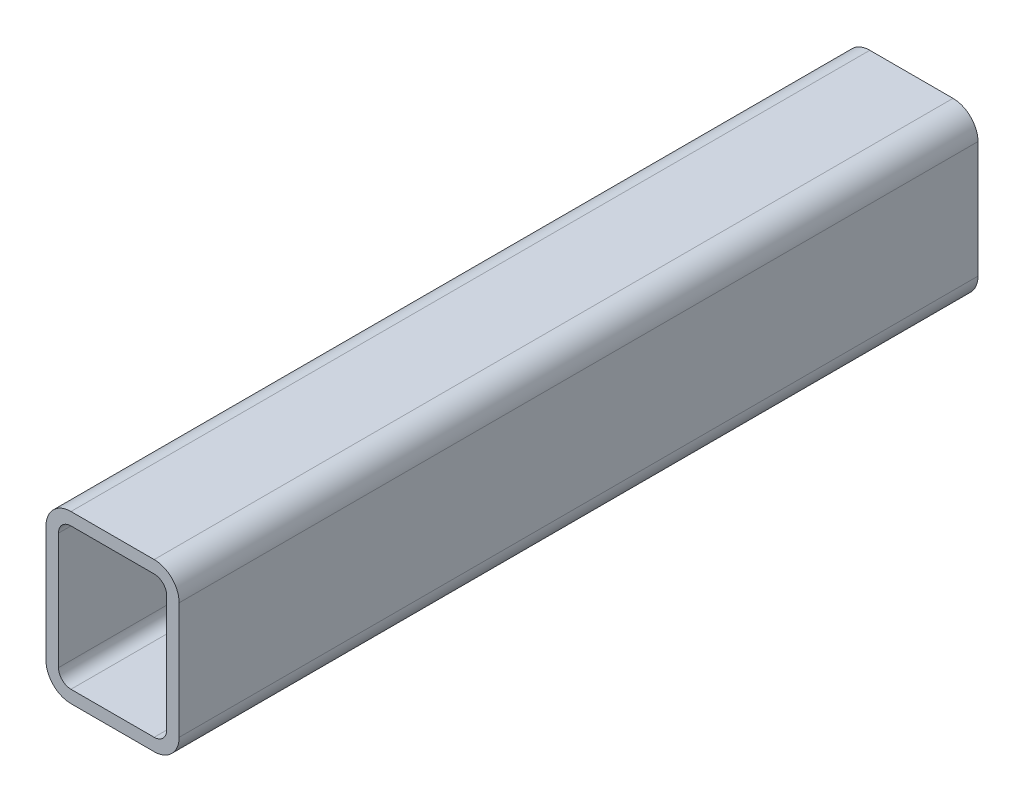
ISO-10303-21;
HEADER;
FILE_DESCRIPTION(('STEP AP214'),'2;1');
FILE_NAME('part.step','',(''),(''),'','','');
FILE_SCHEMA(('AUTOMOTIVE_DESIGN { 1 0 10303 214 1 1 1 1 }'));
ENDSEC;
DATA;
#1=APPLICATION_CONTEXT('core data for automotive mechanical design processes');
#2=APPLICATION_PROTOCOL_DEFINITION('international standard','automotive_design',2000,#1);
#3=PRODUCT_CONTEXT('',#1,'mechanical');
#4=PRODUCT('Part','Part','',(#3));
#5=PRODUCT_RELATED_PRODUCT_CATEGORY('part','',(#4));
#6=PRODUCT_DEFINITION_FORMATION('','',#4);
#7=PRODUCT_DEFINITION_CONTEXT('part definition',#1,'design');
#8=PRODUCT_DEFINITION('design','',#6,#7);
#9=PRODUCT_DEFINITION_SHAPE('','',#8);
#10=(LENGTH_UNIT() NAMED_UNIT(*) SI_UNIT(.MILLI.,.METRE.));
#11=(NAMED_UNIT(*) PLANE_ANGLE_UNIT() SI_UNIT($,.RADIAN.));
#12=(NAMED_UNIT(*) SI_UNIT($,.STERADIAN.) SOLID_ANGLE_UNIT());
#13=UNCERTAINTY_MEASURE_WITH_UNIT(LENGTH_MEASURE(1.E-05),#10,'distance_accuracy_value','');
#14=(GEOMETRIC_REPRESENTATION_CONTEXT(3) GLOBAL_UNCERTAINTY_ASSIGNED_CONTEXT((#13)) GLOBAL_UNIT_ASSIGNED_CONTEXT((#10,
#11,#12)) REPRESENTATION_CONTEXT('',''));
#15=CARTESIAN_POINT('',(0.,0.,0.));
#16=DIRECTION('',(0.,0.,1.));
#17=DIRECTION('',(1.,0.,0.));
#18=AXIS2_PLACEMENT_3D('',#15,#16,#17);
#19=CARTESIAN_POINT('',(9.525,53.975,304.8));
#20=DIRECTION('',(0.,0.,1.));
#21=DIRECTION('',(1.,0.,0.));
#22=AXIS2_PLACEMENT_3D('',#19,#20,#21);
#23=PLANE('',#22);
#24=CARTESIAN_POINT('',(9.525,53.975,304.8));
#25=DIRECTION('',(0.,0.,1.));
#26=DIRECTION('',(1.,0.,0.));
#27=AXIS2_PLACEMENT_3D('',#24,#25,#26);
#28=CIRCLE('',#27,9.525);
#29=CARTESIAN_POINT('',(9.525,63.5,304.8));
#30=VERTEX_POINT('',#29);
#31=CARTESIAN_POINT('',(0.,53.975,304.8));
#32=VERTEX_POINT('',#31);
#33=EDGE_CURVE('E211',#30,#32,#28,.T.);
#34=ORIENTED_EDGE('',*,*,#33,.T.);
#35=DIRECTION('',(0.,-1.,0.));
#36=VECTOR('',#35,1.);
#37=CARTESIAN_POINT('',(0.,9.525,304.8));
#38=LINE('',#37,#36);
#39=CARTESIAN_POINT('',(0.,9.525,304.8));
#40=VERTEX_POINT('',#39);
#41=EDGE_CURVE('E214',#32,#40,#38,.T.);
#42=ORIENTED_EDGE('',*,*,#41,.T.);
#43=CARTESIAN_POINT('',(9.525,9.525,304.8));
#44=DIRECTION('',(0.,0.,1.));
#45=DIRECTION('',(1.,0.,0.));
#46=AXIS2_PLACEMENT_3D('',#43,#44,#45);
#47=CIRCLE('',#46,9.525);
#48=CARTESIAN_POINT('',(9.525,0.,304.8));
#49=VERTEX_POINT('',#48);
#50=EDGE_CURVE('E217',#40,#49,#47,.T.);
#51=ORIENTED_EDGE('',*,*,#50,.T.);
#52=DIRECTION('',(1.,0.,0.));
#53=VECTOR('',#52,1.);
#54=CARTESIAN_POINT('',(41.275,0.,304.8));
#55=LINE('',#54,#53);
#56=CARTESIAN_POINT('',(41.275,0.,304.8));
#57=VERTEX_POINT('',#56);
#58=EDGE_CURVE('E219',#49,#57,#55,.T.);
#59=ORIENTED_EDGE('',*,*,#58,.T.);
#60=CARTESIAN_POINT('',(41.275,9.525,304.8));
#61=DIRECTION('',(0.,0.,1.));
#62=DIRECTION('',(1.,0.,0.));
#63=AXIS2_PLACEMENT_3D('',#60,#61,#62);
#64=CIRCLE('',#63,9.525);
#65=CARTESIAN_POINT('',(50.8,9.525,304.8));
#66=VERTEX_POINT('',#65);
#67=EDGE_CURVE('E221',#57,#66,#64,.T.);
#68=ORIENTED_EDGE('',*,*,#67,.T.);
#69=DIRECTION('',(0.,1.,0.));
#70=VECTOR('',#69,1.);
#71=CARTESIAN_POINT('',(50.8,53.975,304.8));
#72=LINE('',#71,#70);
#73=CARTESIAN_POINT('',(50.8,53.975,304.8));
#74=VERTEX_POINT('',#73);
#75=EDGE_CURVE('E223',#66,#74,#72,.T.);
#76=ORIENTED_EDGE('',*,*,#75,.T.);
#77=CARTESIAN_POINT('',(41.275,53.975,304.8));
#78=DIRECTION('',(0.,0.,1.));
#79=DIRECTION('',(1.,0.,0.));
#80=AXIS2_PLACEMENT_3D('',#77,#78,#79);
#81=CIRCLE('',#80,9.525);
#82=CARTESIAN_POINT('',(41.275,63.5,304.8));
#83=VERTEX_POINT('',#82);
#84=EDGE_CURVE('E225',#74,#83,#81,.T.);
#85=ORIENTED_EDGE('',*,*,#84,.T.);
#86=DIRECTION('',(-1.,0.,0.));
#87=VECTOR('',#86,1.);
#88=CARTESIAN_POINT('',(9.525,63.5,304.8));
#89=LINE('',#88,#87);
#90=EDGE_CURVE('E227',#83,#30,#89,.T.);
#91=ORIENTED_EDGE('',*,*,#90,.T.);
#92=EDGE_LOOP('',(#34,#42,#51,#59,#68,#76,#85,#91));
#93=FACE_BOUND('',#92,.T.);
#94=DIRECTION('',(0.,-1.,0.));
#95=VECTOR('',#94,1.);
#96=CARTESIAN_POINT('',(4.7625,9.525,304.8));
#97=LINE('',#96,#95);
#98=CARTESIAN_POINT('',(4.7625,53.975,304.8));
#99=VERTEX_POINT('',#98);
#100=CARTESIAN_POINT('',(4.7625,9.525,304.8));
#101=VERTEX_POINT('',#100);
#102=EDGE_CURVE('E154',#99,#101,#97,.T.);
#103=ORIENTED_EDGE('',*,*,#102,.F.);
#104=CARTESIAN_POINT('',(9.525,53.975,304.8));
#105=DIRECTION('',(0.,0.,1.));
#106=DIRECTION('',(1.,0.,0.));
#107=AXIS2_PLACEMENT_3D('',#104,#105,#106);
#108=CIRCLE('',#107,4.76249999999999);
#109=CARTESIAN_POINT('',(9.525,58.7375,304.8));
#110=VERTEX_POINT('',#109);
#111=EDGE_CURVE('E146',#110,#99,#108,.T.);
#112=ORIENTED_EDGE('',*,*,#111,.F.);
#113=DIRECTION('',(-1.,0.,0.));
#114=VECTOR('',#113,1.);
#115=CARTESIAN_POINT('',(9.525,58.7375,304.8));
#116=LINE('',#115,#114);
#117=CARTESIAN_POINT('',(41.275,58.7375,304.8));
#118=VERTEX_POINT('',#117);
#119=EDGE_CURVE('E179',#118,#110,#116,.T.);
#120=ORIENTED_EDGE('',*,*,#119,.F.);
#121=CARTESIAN_POINT('',(41.275,53.975,304.8));
#122=DIRECTION('',(0.,0.,1.));
#123=DIRECTION('',(1.,0.,0.));
#124=AXIS2_PLACEMENT_3D('',#121,#122,#123);
#125=CIRCLE('',#124,4.7625);
#126=CARTESIAN_POINT('',(46.0375,53.975,304.8));
#127=VERTEX_POINT('',#126);
#128=EDGE_CURVE('E177',#127,#118,#125,.T.);
#129=ORIENTED_EDGE('',*,*,#128,.F.);
#130=DIRECTION('',(0.,1.,0.));
#131=VECTOR('',#130,1.);
#132=CARTESIAN_POINT('',(46.0375,53.975,304.8));
#133=LINE('',#132,#131);
#134=CARTESIAN_POINT('',(46.0375,9.525,304.8));
#135=VERTEX_POINT('',#134);
#136=EDGE_CURVE('E175',#135,#127,#133,.T.);
#137=ORIENTED_EDGE('',*,*,#136,.F.);
#138=CARTESIAN_POINT('',(41.275,9.525,304.8));
#139=DIRECTION('',(0.,0.,1.));
#140=DIRECTION('',(1.,0.,0.));
#141=AXIS2_PLACEMENT_3D('',#138,#139,#140);
#142=CIRCLE('',#141,4.7625);
#143=CARTESIAN_POINT('',(41.275,4.7625,304.8));
#144=VERTEX_POINT('',#143);
#145=EDGE_CURVE('E173',#144,#135,#142,.T.);
#146=ORIENTED_EDGE('',*,*,#145,.F.);
#147=DIRECTION('',(1.,0.,0.));
#148=VECTOR('',#147,1.);
#149=CARTESIAN_POINT('',(41.275,4.7625,304.8));
#150=LINE('',#149,#148);
#151=CARTESIAN_POINT('',(9.525,4.7625,304.8));
#152=VERTEX_POINT('',#151);
#153=EDGE_CURVE('E169',#152,#144,#150,.T.);
#154=ORIENTED_EDGE('',*,*,#153,.F.);
#155=CARTESIAN_POINT('',(9.525,9.525,304.8));
#156=DIRECTION('',(0.,0.,1.));
#157=DIRECTION('',(1.,0.,0.));
#158=AXIS2_PLACEMENT_3D('',#155,#156,#157);
#159=CIRCLE('',#158,4.7625);
#160=EDGE_CURVE('E167',#101,#152,#159,.T.);
#161=ORIENTED_EDGE('',*,*,#160,.F.);
#162=EDGE_LOOP('',(#103,#112,#120,#129,#137,#146,#154,#161));
#163=FACE_BOUND('',#162,.T.);
#164=ADVANCED_FACE('F33',(#93,#163),#23,.T.);
#165=CARTESIAN_POINT('',(9.525,53.975,0.));
#166=DIRECTION('',(0.,0.,1.));
#167=DIRECTION('',(1.,0.,0.));
#168=AXIS2_PLACEMENT_3D('',#165,#166,#167);
#169=PLANE('',#168);
#170=CARTESIAN_POINT('',(9.525,53.975,0.));
#171=DIRECTION('',(0.,0.,1.));
#172=DIRECTION('',(1.,0.,0.));
#173=AXIS2_PLACEMENT_3D('',#170,#171,#172);
#174=CIRCLE('',#173,9.525);
#175=CARTESIAN_POINT('',(9.525,63.5,0.));
#176=VERTEX_POINT('',#175);
#177=CARTESIAN_POINT('',(0.,53.975,0.));
#178=VERTEX_POINT('',#177);
#179=EDGE_CURVE('E162',#176,#178,#174,.T.);
#180=ORIENTED_EDGE('',*,*,#179,.F.);
#181=DIRECTION('',(-1.,0.,0.));
#182=VECTOR('',#181,1.);
#183=CARTESIAN_POINT('',(9.525,63.5,0.));
#184=LINE('',#183,#182);
#185=CARTESIAN_POINT('',(41.275,63.5,0.));
#186=VERTEX_POINT('',#185);
#187=EDGE_CURVE('E215',#186,#176,#184,.T.);
#188=ORIENTED_EDGE('',*,*,#187,.F.);
#189=CARTESIAN_POINT('',(41.275,53.975,0.));
#190=DIRECTION('',(0.,0.,1.));
#191=DIRECTION('',(1.,0.,0.));
#192=AXIS2_PLACEMENT_3D('',#189,#190,#191);
#193=CIRCLE('',#192,9.525);
#194=CARTESIAN_POINT('',(50.8,53.975,0.));
#195=VERTEX_POINT('',#194);
#196=EDGE_CURVE('E242',#195,#186,#193,.T.);
#197=ORIENTED_EDGE('',*,*,#196,.F.);
#198=DIRECTION('',(0.,1.,0.));
#199=VECTOR('',#198,1.);
#200=CARTESIAN_POINT('',(50.8,53.975,0.));
#201=LINE('',#200,#199);
#202=CARTESIAN_POINT('',(50.8,9.525,0.));
#203=VERTEX_POINT('',#202);
#204=EDGE_CURVE('E240',#203,#195,#201,.T.);
#205=ORIENTED_EDGE('',*,*,#204,.F.);
#206=CARTESIAN_POINT('',(41.275,9.525,0.));
#207=DIRECTION('',(0.,0.,1.));
#208=DIRECTION('',(1.,0.,0.));
#209=AXIS2_PLACEMENT_3D('',#206,#207,#208);
#210=CIRCLE('',#209,9.525);
#211=CARTESIAN_POINT('',(41.275,0.,0.));
#212=VERTEX_POINT('',#211);
#213=EDGE_CURVE('E238',#212,#203,#210,.T.);
#214=ORIENTED_EDGE('',*,*,#213,.F.);
#215=DIRECTION('',(1.,0.,0.));
#216=VECTOR('',#215,1.);
#217=CARTESIAN_POINT('',(41.275,0.,0.));
#218=LINE('',#217,#216);
#219=CARTESIAN_POINT('',(9.525,0.,0.));
#220=VERTEX_POINT('',#219);
#221=EDGE_CURVE('E236',#220,#212,#218,.T.);
#222=ORIENTED_EDGE('',*,*,#221,.F.);
#223=CARTESIAN_POINT('',(9.525,9.525,0.));
#224=DIRECTION('',(0.,0.,1.));
#225=DIRECTION('',(1.,0.,0.));
#226=AXIS2_PLACEMENT_3D('',#223,#224,#225);
#227=CIRCLE('',#226,9.525);
#228=CARTESIAN_POINT('',(0.,9.525,0.));
#229=VERTEX_POINT('',#228);
#230=EDGE_CURVE('E234',#229,#220,#227,.T.);
#231=ORIENTED_EDGE('',*,*,#230,.F.);
#232=DIRECTION('',(0.,-1.,0.));
#233=VECTOR('',#232,1.);
#234=CARTESIAN_POINT('',(0.,9.525,0.));
#235=LINE('',#234,#233);
#236=EDGE_CURVE('E232',#178,#229,#235,.T.);
#237=ORIENTED_EDGE('',*,*,#236,.F.);
#238=EDGE_LOOP('',(#180,#188,#197,#205,#214,#222,#231,#237));
#239=FACE_BOUND('',#238,.T.);
#240=CARTESIAN_POINT('',(9.525,53.975,0.));
#241=DIRECTION('',(0.,0.,1.));
#242=DIRECTION('',(1.,0.,0.));
#243=AXIS2_PLACEMENT_3D('',#240,#241,#242);
#244=CIRCLE('',#243,4.76249999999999);
#245=CARTESIAN_POINT('',(9.525,58.7375,0.));
#246=VERTEX_POINT('',#245);
#247=CARTESIAN_POINT('',(4.7625,53.975,0.));
#248=VERTEX_POINT('',#247);
#249=EDGE_CURVE('E56',#246,#248,#244,.T.);
#250=ORIENTED_EDGE('',*,*,#249,.T.);
#251=DIRECTION('',(0.,-1.,0.));
#252=VECTOR('',#251,1.);
#253=CARTESIAN_POINT('',(4.7625,9.525,0.));
#254=LINE('',#253,#252);
#255=CARTESIAN_POINT('',(4.7625,9.525,0.));
#256=VERTEX_POINT('',#255);
#257=EDGE_CURVE('E161',#248,#256,#254,.T.);
#258=ORIENTED_EDGE('',*,*,#257,.T.);
#259=CARTESIAN_POINT('',(9.525,9.525,0.));
#260=DIRECTION('',(0.,0.,1.));
#261=DIRECTION('',(1.,0.,0.));
#262=AXIS2_PLACEMENT_3D('',#259,#260,#261);
#263=CIRCLE('',#262,4.7625);
#264=CARTESIAN_POINT('',(9.525,4.7625,0.));
#265=VERTEX_POINT('',#264);
#266=EDGE_CURVE('E183',#256,#265,#263,.T.);
#267=ORIENTED_EDGE('',*,*,#266,.T.);
#268=DIRECTION('',(1.,0.,0.));
#269=VECTOR('',#268,1.);
#270=CARTESIAN_POINT('',(41.275,4.7625,0.));
#271=LINE('',#270,#269);
#272=CARTESIAN_POINT('',(41.275,4.7625,0.));
#273=VERTEX_POINT('',#272);
#274=EDGE_CURVE('E186',#265,#273,#271,.T.);
#275=ORIENTED_EDGE('',*,*,#274,.T.);
#276=CARTESIAN_POINT('',(41.275,9.525,0.));
#277=DIRECTION('',(0.,0.,1.));
#278=DIRECTION('',(1.,0.,0.));
#279=AXIS2_PLACEMENT_3D('',#276,#277,#278);
#280=CIRCLE('',#279,4.7625);
#281=CARTESIAN_POINT('',(46.0375,9.525,0.));
#282=VERTEX_POINT('',#281);
#283=EDGE_CURVE('E189',#273,#282,#280,.T.);
#284=ORIENTED_EDGE('',*,*,#283,.T.);
#285=DIRECTION('',(0.,1.,0.));
#286=VECTOR('',#285,1.);
#287=CARTESIAN_POINT('',(46.0375,53.975,0.));
#288=LINE('',#287,#286);
#289=CARTESIAN_POINT('',(46.0375,53.975,0.));
#290=VERTEX_POINT('',#289);
#291=EDGE_CURVE('E192',#282,#290,#288,.T.);
#292=ORIENTED_EDGE('',*,*,#291,.T.);
#293=CARTESIAN_POINT('',(41.275,53.975,0.));
#294=DIRECTION('',(0.,0.,1.));
#295=DIRECTION('',(1.,0.,0.));
#296=AXIS2_PLACEMENT_3D('',#293,#294,#295);
#297=CIRCLE('',#296,4.7625);
#298=CARTESIAN_POINT('',(41.275,58.7375,0.));
#299=VERTEX_POINT('',#298);
#300=EDGE_CURVE('E195',#290,#299,#297,.T.);
#301=ORIENTED_EDGE('',*,*,#300,.T.);
#302=DIRECTION('',(-1.,0.,0.));
#303=VECTOR('',#302,1.);
#304=CARTESIAN_POINT('',(9.525,58.7375,0.));
#305=LINE('',#304,#303);
#306=EDGE_CURVE('E155',#299,#246,#305,.T.);
#307=ORIENTED_EDGE('',*,*,#306,.T.);
#308=EDGE_LOOP('',(#250,#258,#267,#275,#284,#292,#301,#307));
#309=FACE_BOUND('',#308,.T.);
#310=ADVANCED_FACE('F272',(#239,#309),#169,.F.);
#311=CARTESIAN_POINT('',(9.525,53.975,304.8));
#312=DIRECTION('',(0.,0.,-1.));
#313=DIRECTION('',(-1.,0.,0.));
#314=AXIS2_PLACEMENT_3D('',#311,#312,#313);
#315=CYLINDRICAL_SURFACE('',#314,9.525);
#316=ORIENTED_EDGE('',*,*,#179,.T.);
#317=DIRECTION('',(0.,0.,-1.));
#318=VECTOR('',#317,1.);
#319=CARTESIAN_POINT('',(0.,53.975,304.8));
#320=LINE('',#319,#318);
#321=EDGE_CURVE('E11',#32,#178,#320,.T.);
#322=ORIENTED_EDGE('',*,*,#321,.F.);
#323=ORIENTED_EDGE('',*,*,#33,.F.);
#324=DIRECTION('',(0.,0.,-1.));
#325=VECTOR('',#324,1.);
#326=CARTESIAN_POINT('',(9.525,63.5,304.8));
#327=LINE('',#326,#325);
#328=EDGE_CURVE('E229',#30,#176,#327,.T.);
#329=ORIENTED_EDGE('',*,*,#328,.T.);
#330=EDGE_LOOP('',(#316,#322,#323,#329));
#331=FACE_BOUND('',#330,.T.);
#332=ADVANCED_FACE('F35',(#331),#315,.T.);
#333=CARTESIAN_POINT('',(0.,9.525,304.8));
#334=DIRECTION('',(1.,0.,0.));
#335=DIRECTION('',(0.,0.,-1.));
#336=AXIS2_PLACEMENT_3D('',#333,#334,#335);
#337=PLANE('',#336);
#338=ORIENTED_EDGE('',*,*,#236,.T.);
#339=DIRECTION('',(0.,0.,-1.));
#340=VECTOR('',#339,1.);
#341=CARTESIAN_POINT('',(0.,9.525,304.8));
#342=LINE('',#341,#340);
#343=EDGE_CURVE('E41',#40,#229,#342,.T.);
#344=ORIENTED_EDGE('',*,*,#343,.F.);
#345=ORIENTED_EDGE('',*,*,#41,.F.);
#346=ORIENTED_EDGE('',*,*,#321,.T.);
#347=EDGE_LOOP('',(#338,#344,#345,#346));
#348=FACE_BOUND('',#347,.T.);
#349=ADVANCED_FACE('F289',(#348),#337,.F.);
#350=CARTESIAN_POINT('',(9.525,9.525,304.8));
#351=DIRECTION('',(0.,0.,-1.));
#352=DIRECTION('',(-1.,0.,0.));
#353=AXIS2_PLACEMENT_3D('',#350,#351,#352);
#354=CYLINDRICAL_SURFACE('',#353,9.525);
#355=ORIENTED_EDGE('',*,*,#230,.T.);
#356=DIRECTION('',(0.,0.,-1.));
#357=VECTOR('',#356,1.);
#358=CARTESIAN_POINT('',(9.525,0.,304.8));
#359=LINE('',#358,#357);
#360=EDGE_CURVE('E259',#49,#220,#359,.T.);
#361=ORIENTED_EDGE('',*,*,#360,.F.);
#362=ORIENTED_EDGE('',*,*,#50,.F.);
#363=ORIENTED_EDGE('',*,*,#343,.T.);
#364=EDGE_LOOP('',(#355,#361,#362,#363));
#365=FACE_BOUND('',#364,.T.);
#366=ADVANCED_FACE('F266',(#365),#354,.T.);
#367=CARTESIAN_POINT('',(41.275,0.,304.8));
#368=DIRECTION('',(0.,1.,0.));
#369=DIRECTION('',(0.,0.,1.));
#370=AXIS2_PLACEMENT_3D('',#367,#368,#369);
#371=PLANE('',#370);
#372=ORIENTED_EDGE('',*,*,#221,.T.);
#373=DIRECTION('',(0.,0.,-1.));
#374=VECTOR('',#373,1.);
#375=CARTESIAN_POINT('',(41.275,0.,304.8));
#376=LINE('',#375,#374);
#377=EDGE_CURVE('E256',#57,#212,#376,.T.);
#378=ORIENTED_EDGE('',*,*,#377,.F.);
#379=ORIENTED_EDGE('',*,*,#58,.F.);
#380=ORIENTED_EDGE('',*,*,#360,.T.);
#381=EDGE_LOOP('',(#372,#378,#379,#380));
#382=FACE_BOUND('',#381,.T.);
#383=ADVANCED_FACE('F278',(#382),#371,.F.);
#384=CARTESIAN_POINT('',(41.275,9.525,304.8));
#385=DIRECTION('',(0.,0.,-1.));
#386=DIRECTION('',(-1.,0.,0.));
#387=AXIS2_PLACEMENT_3D('',#384,#385,#386);
#388=CYLINDRICAL_SURFACE('',#387,9.525);
#389=ORIENTED_EDGE('',*,*,#213,.T.);
#390=DIRECTION('',(0.,0.,-1.));
#391=VECTOR('',#390,1.);
#392=CARTESIAN_POINT('',(50.8,9.525,304.8));
#393=LINE('',#392,#391);
#394=EDGE_CURVE('E253',#66,#203,#393,.T.);
#395=ORIENTED_EDGE('',*,*,#394,.F.);
#396=ORIENTED_EDGE('',*,*,#67,.F.);
#397=ORIENTED_EDGE('',*,*,#377,.T.);
#398=EDGE_LOOP('',(#389,#395,#396,#397));
#399=FACE_BOUND('',#398,.T.);
#400=ADVANCED_FACE('F282',(#399),#388,.T.);
#401=CARTESIAN_POINT('',(50.8,53.975,304.8));
#402=DIRECTION('',(-1.,0.,0.));
#403=DIRECTION('',(0.,0.,1.));
#404=AXIS2_PLACEMENT_3D('',#401,#402,#403);
#405=PLANE('',#404);
#406=ORIENTED_EDGE('',*,*,#204,.T.);
#407=DIRECTION('',(0.,0.,-1.));
#408=VECTOR('',#407,1.);
#409=CARTESIAN_POINT('',(50.8,53.975,304.8));
#410=LINE('',#409,#408);
#411=EDGE_CURVE('E250',#74,#195,#410,.T.);
#412=ORIENTED_EDGE('',*,*,#411,.F.);
#413=ORIENTED_EDGE('',*,*,#75,.F.);
#414=ORIENTED_EDGE('',*,*,#394,.T.);
#415=EDGE_LOOP('',(#406,#412,#413,#414));
#416=FACE_BOUND('',#415,.T.);
#417=ADVANCED_FACE('F302',(#416),#405,.F.);
#418=CARTESIAN_POINT('',(41.275,53.975,304.8));
#419=DIRECTION('',(0.,0.,-1.));
#420=DIRECTION('',(-1.,0.,0.));
#421=AXIS2_PLACEMENT_3D('',#418,#419,#420);
#422=CYLINDRICAL_SURFACE('',#421,9.525);
#423=ORIENTED_EDGE('',*,*,#196,.T.);
#424=DIRECTION('',(0.,0.,-1.));
#425=VECTOR('',#424,1.);
#426=CARTESIAN_POINT('',(41.275,63.5,304.8));
#427=LINE('',#426,#425);
#428=EDGE_CURVE('E247',#83,#186,#427,.T.);
#429=ORIENTED_EDGE('',*,*,#428,.F.);
#430=ORIENTED_EDGE('',*,*,#84,.F.);
#431=ORIENTED_EDGE('',*,*,#411,.T.);
#432=EDGE_LOOP('',(#423,#429,#430,#431));
#433=FACE_BOUND('',#432,.T.);
#434=ADVANCED_FACE('F300',(#433),#422,.T.);
#435=CARTESIAN_POINT('',(9.525,63.5,304.8));
#436=DIRECTION('',(0.,-1.,0.));
#437=DIRECTION('',(0.,0.,-1.));
#438=AXIS2_PLACEMENT_3D('',#435,#436,#437);
#439=PLANE('',#438);
#440=ORIENTED_EDGE('',*,*,#187,.T.);
#441=ORIENTED_EDGE('',*,*,#328,.F.);
#442=ORIENTED_EDGE('',*,*,#90,.F.);
#443=ORIENTED_EDGE('',*,*,#428,.T.);
#444=EDGE_LOOP('',(#440,#441,#442,#443));
#445=FACE_BOUND('',#444,.T.);
#446=ADVANCED_FACE('F295',(#445),#439,.F.);
#447=CARTESIAN_POINT('',(9.525,53.975,304.8));
#448=DIRECTION('',(0.,0.,-1.));
#449=DIRECTION('',(-1.,0.,0.));
#450=AXIS2_PLACEMENT_3D('',#447,#448,#449);
#451=CYLINDRICAL_SURFACE('',#450,4.76249999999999);
#452=ORIENTED_EDGE('',*,*,#249,.F.);
#453=DIRECTION('',(0.,0.,-1.));
#454=VECTOR('',#453,1.);
#455=CARTESIAN_POINT('',(9.525,58.7375,304.8));
#456=LINE('',#455,#454);
#457=EDGE_CURVE('E150',#110,#246,#456,.T.);
#458=ORIENTED_EDGE('',*,*,#457,.F.);
#459=ORIENTED_EDGE('',*,*,#111,.T.);
#460=DIRECTION('',(0.,0.,-1.));
#461=VECTOR('',#460,1.);
#462=CARTESIAN_POINT('',(4.7625,53.975,304.8));
#463=LINE('',#462,#461);
#464=EDGE_CURVE('E149',#99,#248,#463,.T.);
#465=ORIENTED_EDGE('',*,*,#464,.T.);
#466=EDGE_LOOP('',(#452,#458,#459,#465));
#467=FACE_BOUND('',#466,.T.);
#468=ADVANCED_FACE('F148',(#467),#451,.F.);
#469=CARTESIAN_POINT('',(4.7625,9.525,304.8));
#470=DIRECTION('',(1.,0.,0.));
#471=DIRECTION('',(0.,0.,-1.));
#472=AXIS2_PLACEMENT_3D('',#469,#470,#471);
#473=PLANE('',#472);
#474=ORIENTED_EDGE('',*,*,#257,.F.);
#475=ORIENTED_EDGE('',*,*,#464,.F.);
#476=ORIENTED_EDGE('',*,*,#102,.T.);
#477=DIRECTION('',(0.,0.,-1.));
#478=VECTOR('',#477,1.);
#479=CARTESIAN_POINT('',(4.7625,9.525,304.8));
#480=LINE('',#479,#478);
#481=EDGE_CURVE('E163',#101,#256,#480,.T.);
#482=ORIENTED_EDGE('',*,*,#481,.T.);
#483=EDGE_LOOP('',(#474,#475,#476,#482));
#484=FACE_BOUND('',#483,.T.);
#485=ADVANCED_FACE('F158',(#484),#473,.T.);
#486=CARTESIAN_POINT('',(9.525,9.525,304.8));
#487=DIRECTION('',(0.,0.,-1.));
#488=DIRECTION('',(-1.,0.,0.));
#489=AXIS2_PLACEMENT_3D('',#486,#487,#488);
#490=CYLINDRICAL_SURFACE('',#489,4.7625);
#491=ORIENTED_EDGE('',*,*,#266,.F.);
#492=ORIENTED_EDGE('',*,*,#481,.F.);
#493=ORIENTED_EDGE('',*,*,#160,.T.);
#494=DIRECTION('',(0.,0.,-1.));
#495=VECTOR('',#494,1.);
#496=CARTESIAN_POINT('',(9.525,4.7625,304.8));
#497=LINE('',#496,#495);
#498=EDGE_CURVE('E208',#152,#265,#497,.T.);
#499=ORIENTED_EDGE('',*,*,#498,.T.);
#500=EDGE_LOOP('',(#491,#492,#493,#499));
#501=FACE_BOUND('',#500,.T.);
#502=ADVANCED_FACE('F327',(#501),#490,.F.);
#503=CARTESIAN_POINT('',(41.275,4.7625,304.8));
#504=DIRECTION('',(0.,1.,0.));
#505=DIRECTION('',(0.,0.,1.));
#506=AXIS2_PLACEMENT_3D('',#503,#504,#505);
#507=PLANE('',#506);
#508=ORIENTED_EDGE('',*,*,#274,.F.);
#509=ORIENTED_EDGE('',*,*,#498,.F.);
#510=ORIENTED_EDGE('',*,*,#153,.T.);
#511=DIRECTION('',(0.,0.,-1.));
#512=VECTOR('',#511,1.);
#513=CARTESIAN_POINT('',(41.275,4.7625,304.8));
#514=LINE('',#513,#512);
#515=EDGE_CURVE('E206',#144,#273,#514,.T.);
#516=ORIENTED_EDGE('',*,*,#515,.T.);
#517=EDGE_LOOP('',(#508,#509,#510,#516));
#518=FACE_BOUND('',#517,.T.);
#519=ADVANCED_FACE('F331',(#518),#507,.T.);
#520=CARTESIAN_POINT('',(41.275,9.525,304.8));
#521=DIRECTION('',(0.,0.,-1.));
#522=DIRECTION('',(-1.,0.,0.));
#523=AXIS2_PLACEMENT_3D('',#520,#521,#522);
#524=CYLINDRICAL_SURFACE('',#523,4.7625);
#525=ORIENTED_EDGE('',*,*,#283,.F.);
#526=ORIENTED_EDGE('',*,*,#515,.F.);
#527=ORIENTED_EDGE('',*,*,#145,.T.);
#528=DIRECTION('',(0.,0.,-1.));
#529=VECTOR('',#528,1.);
#530=CARTESIAN_POINT('',(46.0375,9.525,304.8));
#531=LINE('',#530,#529);
#532=EDGE_CURVE('E204',#135,#282,#531,.T.);
#533=ORIENTED_EDGE('',*,*,#532,.T.);
#534=EDGE_LOOP('',(#525,#526,#527,#533));
#535=FACE_BOUND('',#534,.T.);
#536=ADVANCED_FACE('F337',(#535),#524,.F.);
#537=CARTESIAN_POINT('',(46.0375,53.975,304.8));
#538=DIRECTION('',(-1.,0.,0.));
#539=DIRECTION('',(0.,0.,1.));
#540=AXIS2_PLACEMENT_3D('',#537,#538,#539);
#541=PLANE('',#540);
#542=ORIENTED_EDGE('',*,*,#291,.F.);
#543=ORIENTED_EDGE('',*,*,#532,.F.);
#544=ORIENTED_EDGE('',*,*,#136,.T.);
#545=DIRECTION('',(0.,0.,-1.));
#546=VECTOR('',#545,1.);
#547=CARTESIAN_POINT('',(46.0375,53.975,304.8));
#548=LINE('',#547,#546);
#549=EDGE_CURVE('E202',#127,#290,#548,.T.);
#550=ORIENTED_EDGE('',*,*,#549,.T.);
#551=EDGE_LOOP('',(#542,#543,#544,#550));
#552=FACE_BOUND('',#551,.T.);
#553=ADVANCED_FACE('F341',(#552),#541,.T.);
#554=CARTESIAN_POINT('',(41.275,53.975,304.8));
#555=DIRECTION('',(0.,0.,-1.));
#556=DIRECTION('',(-1.,0.,0.));
#557=AXIS2_PLACEMENT_3D('',#554,#555,#556);
#558=CYLINDRICAL_SURFACE('',#557,4.7625);
#559=ORIENTED_EDGE('',*,*,#300,.F.);
#560=ORIENTED_EDGE('',*,*,#549,.F.);
#561=ORIENTED_EDGE('',*,*,#128,.T.);
#562=DIRECTION('',(0.,0.,-1.));
#563=VECTOR('',#562,1.);
#564=CARTESIAN_POINT('',(41.275,58.7375,304.8));
#565=LINE('',#564,#563);
#566=EDGE_CURVE('E48',#118,#299,#565,.T.);
#567=ORIENTED_EDGE('',*,*,#566,.T.);
#568=EDGE_LOOP('',(#559,#560,#561,#567));
#569=FACE_BOUND('',#568,.T.);
#570=ADVANCED_FACE('F345',(#569),#558,.F.);
#571=CARTESIAN_POINT('',(9.525,58.7375,304.8));
#572=DIRECTION('',(0.,-1.,0.));
#573=DIRECTION('',(0.,0.,-1.));
#574=AXIS2_PLACEMENT_3D('',#571,#572,#573);
#575=PLANE('',#574);
#576=ORIENTED_EDGE('',*,*,#306,.F.);
#577=ORIENTED_EDGE('',*,*,#566,.F.);
#578=ORIENTED_EDGE('',*,*,#119,.T.);
#579=ORIENTED_EDGE('',*,*,#457,.T.);
#580=EDGE_LOOP('',(#576,#577,#578,#579));
#581=FACE_BOUND('',#580,.T.);
#582=ADVANCED_FACE('F349',(#581),#575,.T.);
#583=CLOSED_SHELL('',(#164,#310,#332,#349,#366,#383,#400,#417,#434,#446,#468,#485,#502,#519,
#536,#553,#570,#582));
#584=MANIFOLD_SOLID_BREP('B2',#583);
#585=ADVANCED_BREP_SHAPE_REPRESENTATION('',(#18,#584),#14);
#586=SHAPE_DEFINITION_REPRESENTATION(#9,#585);
ENDSEC;
END-ISO-10303-21;
